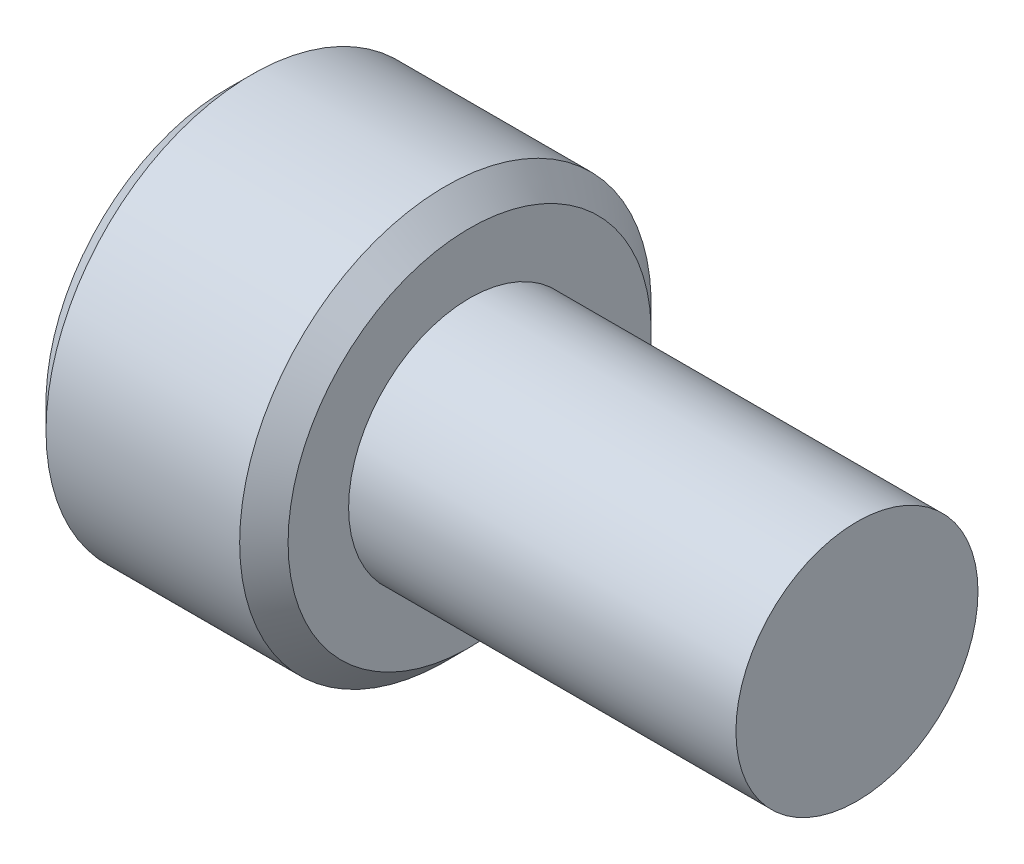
from build123d import *

# Parameters (mm, degrees)
CUT_EXTRUDE1_DEPTH = 2
CHAMFER1_SIZE      = 0.5


with BuildPart() as part:
    # Sketch1 → Revolve1 (revolve)
    with BuildSketch(Plane.XY, mode=Mode.PRIVATE) as revolve1_sk:
        Polygon((0, 2.5), (8, 2.5), (8, 0), (-5, 0), (-5, 4.25), (0, 4.25), align=None)
    revolve(revolve1_sk.sketch.rotate(Axis((-5.65, 0, 0), (1, 0, 0)), 90), axis=Axis((-5.65, 0, 0), (1, 0, 0)))

    # Sketch2 → Cut-Revolve1 (revolve, cut)
    with BuildSketch(Plane.XY, mode=Mode.PRIVATE) as cut_revolve1_sk:
        Polygon((-1.798278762, 0), (-3, 2), (-5, 2), (-5, 0), align=None)
    revolve(cut_revolve1_sk.sketch.rotate(Axis((-5.65, 0, 0), (1, 0, 0)), 90), axis=Axis((-5.65, 0, 0), (1, 0, 0)), mode=Mode.SUBTRACT)

    # Sketch3 → Cut-Extrude1 (cut)
    with BuildSketch(Plane.ZY.offset(5)):
        Polygon((2, 1.154700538), (0, 2.309401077), (-2, 1.154700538), (-2, -1.154700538), (0, -2.309401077), (2, -1.154700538), align=None)
    extrude(amount=-CUT_EXTRUDE1_DEPTH, mode=Mode.SUBTRACT)

    # Chamfer1
    chamfer1_edges = [part.edges().sort_by_distance(p)[0] for p in [
        (-5, 0, -4.25),
        (0, 0, -4.25),
    ]]
    chamfer(chamfer1_edges, length=CHAMFER1_SIZE)


solid = part.part
